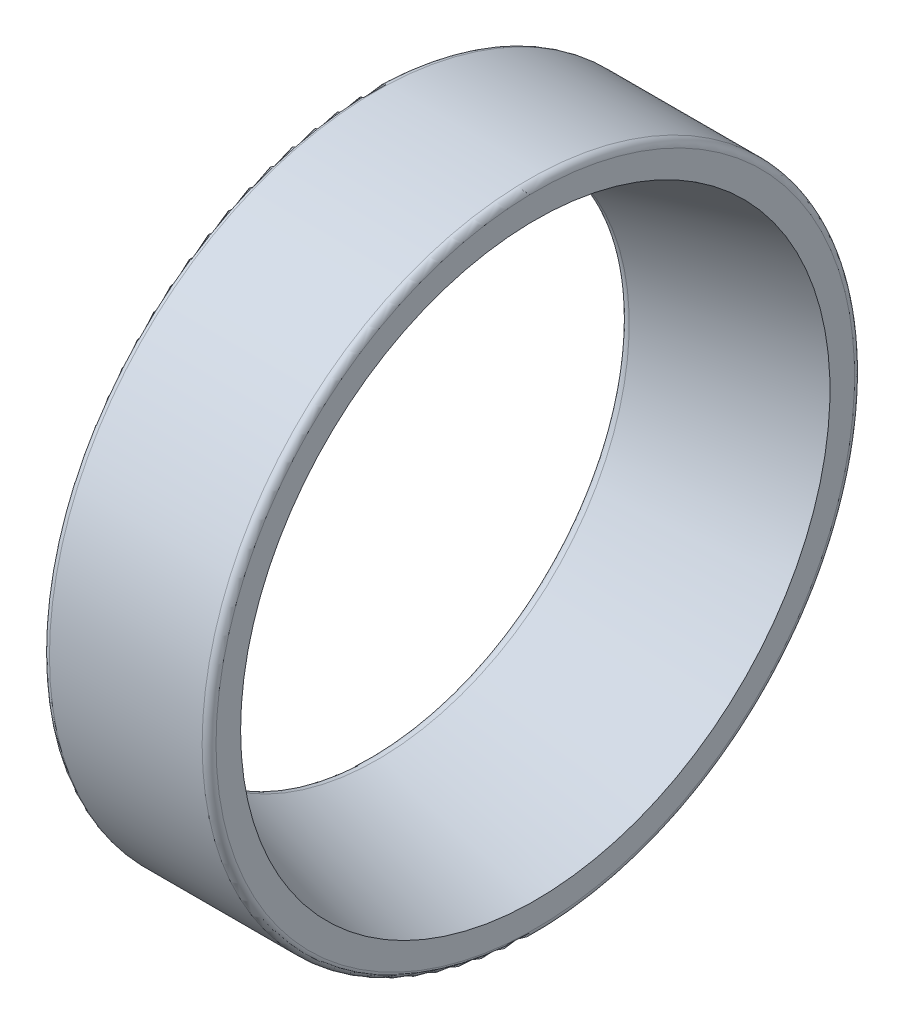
from build123d import *


with BuildPart() as part:
    # Esquisse1 → Base-R_volution (revolve)
    with BuildSketch(Plane(origin=(0, 0, 0), x_dir=(1, 0, 0), z_dir=(0, 1, 0)), mode=Mode.PRIVATE) as base_r_volution_sk:
        with BuildLine():
            Line((0, 18.620383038), (0, 23))
            ThreePointArc((0, 23), (0.146446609, 23.353553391), (0.5, 23.5))
            Line((0.5, 23.5), (11.5, 23.5))
            ThreePointArc((11.5, 23.5), (11.853553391, 23.353553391), (12, 23))
            Line((12, 23), (12, 21.229190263))
            Line((12, 21.229190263), (10.572232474, 20.840966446))
            Line((10.572232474, 20.840966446), (0.872432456, 18.203496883))
            Line((0.872432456, 18.203496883), (0.631191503, 18.137901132))
            ThreePointArc((0.631191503, 18.137901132), (0.196351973, 18.22314523), (0, 18.620383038))
        make_face()
    revolve(base_r_volution_sk.sketch.rotate(Axis((0, 0, 0), (1, 0, 0)), 180), axis=Axis((0, 0, 0), (1, 0, 0)))


solid = part.part
